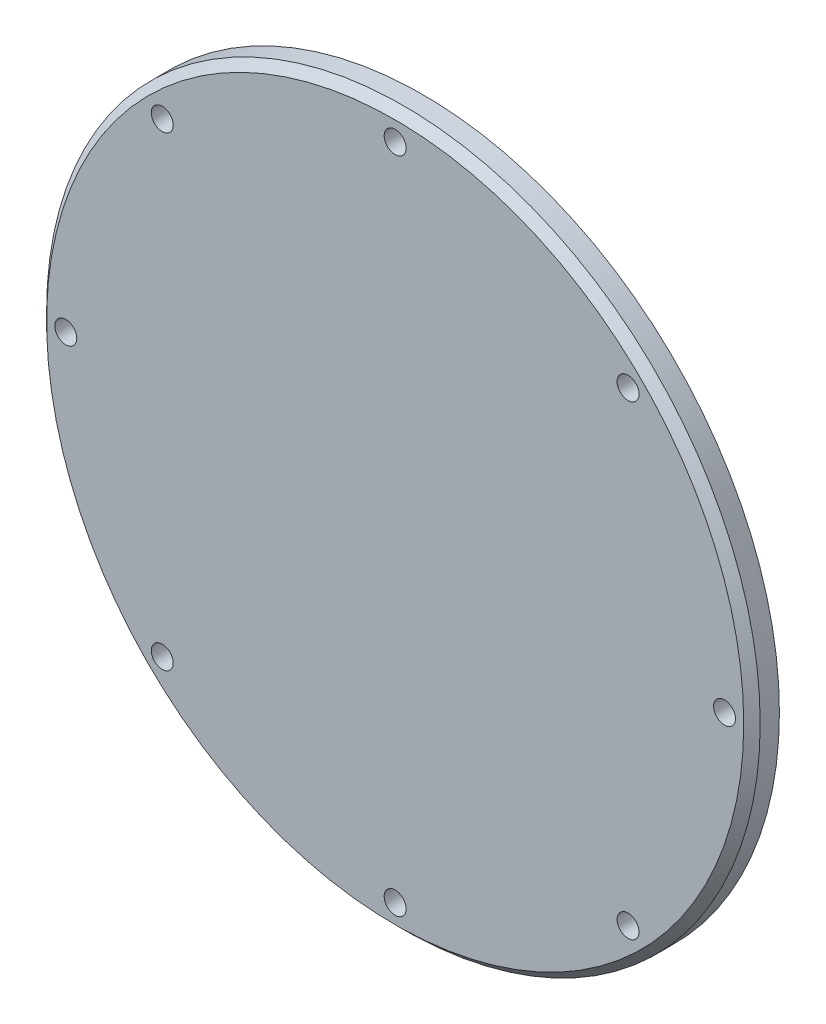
from build123d import *

# Parameters (mm, degrees)
ESQUISSE1_R        = 130
ESQUISSE1_R_2      = 4
BOSS_EXTRU_1_DEPTH = 10
CHANFREIN1_SIZE    = 3


with BuildPart() as part:
    # Esquisse1 → Boss.-Extru.1 (new body)
    with BuildSketch(Plane.XY):
        with Locations((-162.897779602, -125)):
            Circle(ESQUISSE1_R)
        with Locations((-78.044965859, -40.147186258)):
            Circle(ESQUISSE1_R_2, mode=Mode.SUBTRACT)
        with Locations((-162.897779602, -5)):
            Circle(ESQUISSE1_R_2, mode=Mode.SUBTRACT)
        with Locations((-247.750593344, -40.147186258)):
            Circle(ESQUISSE1_R_2, mode=Mode.SUBTRACT)
        with Locations((-282.897779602, -125)):
            Circle(ESQUISSE1_R_2, mode=Mode.SUBTRACT)
        with Locations((-247.750593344, -209.852813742)):
            Circle(ESQUISSE1_R_2, mode=Mode.SUBTRACT)
        with Locations((-162.897779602, -245)):
            Circle(ESQUISSE1_R_2, mode=Mode.SUBTRACT)
        with Locations((-78.044965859, -209.852813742)):
            Circle(ESQUISSE1_R_2, mode=Mode.SUBTRACT)
        with Locations((-42.897779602, -125)):
            Circle(ESQUISSE1_R_2, mode=Mode.SUBTRACT)
    extrude(amount=BOSS_EXTRU_1_DEPTH)

    # Chanfrein1
    chanfrein1_edges = [part.edges().sort_by_distance(p)[0] for p in [
        (-292.897779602, -125, 10),
    ]]
    chamfer(chanfrein1_edges, length=CHANFREIN1_SIZE)


solid = part.part
